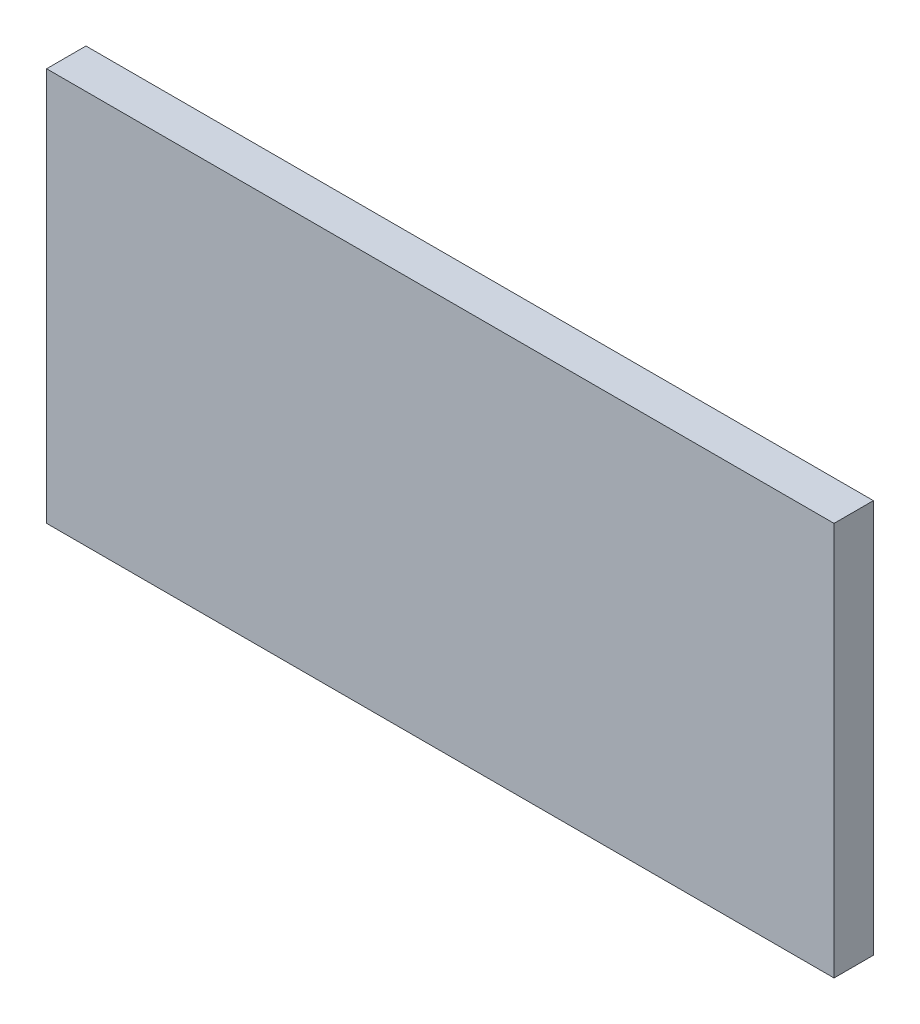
ISO-10303-21;
HEADER;
FILE_DESCRIPTION(('STEP AP214'),'2;1');
FILE_NAME('part.step','',(''),(''),'','','');
FILE_SCHEMA(('AUTOMOTIVE_DESIGN { 1 0 10303 214 1 1 1 1 }'));
ENDSEC;
DATA;
#1=APPLICATION_CONTEXT('core data for automotive mechanical design processes');
#2=APPLICATION_PROTOCOL_DEFINITION('international standard','automotive_design',2000,#1);
#3=PRODUCT_CONTEXT('',#1,'mechanical');
#4=PRODUCT('Part','Part','',(#3));
#5=PRODUCT_RELATED_PRODUCT_CATEGORY('part','',(#4));
#6=PRODUCT_DEFINITION_FORMATION('','',#4);
#7=PRODUCT_DEFINITION_CONTEXT('part definition',#1,'design');
#8=PRODUCT_DEFINITION('design','',#6,#7);
#9=PRODUCT_DEFINITION_SHAPE('','',#8);
#10=(LENGTH_UNIT() NAMED_UNIT(*) SI_UNIT(.MILLI.,.METRE.));
#11=(NAMED_UNIT(*) PLANE_ANGLE_UNIT() SI_UNIT($,.RADIAN.));
#12=(NAMED_UNIT(*) SI_UNIT($,.STERADIAN.) SOLID_ANGLE_UNIT());
#13=UNCERTAINTY_MEASURE_WITH_UNIT(LENGTH_MEASURE(1.E-05),#10,'distance_accuracy_value','');
#14=(GEOMETRIC_REPRESENTATION_CONTEXT(3) GLOBAL_UNCERTAINTY_ASSIGNED_CONTEXT((#13)) GLOBAL_UNIT_ASSIGNED_CONTEXT((#10,
#11,#12)) REPRESENTATION_CONTEXT('',''));
#15=CARTESIAN_POINT('',(0.,0.,0.));
#16=DIRECTION('',(0.,0.,1.));
#17=DIRECTION('',(1.,0.,0.));
#18=AXIS2_PLACEMENT_3D('',#15,#16,#17);
#19=CARTESIAN_POINT('',(-100.,-50.,10.));
#20=DIRECTION('',(1.,0.,0.));
#21=DIRECTION('',(0.,0.,-1.));
#22=AXIS2_PLACEMENT_3D('',#19,#20,#21);
#23=PLANE('',#22);
#24=DIRECTION('',(0.,-1.,0.));
#25=VECTOR('',#24,1.);
#26=CARTESIAN_POINT('',(-100.,-50.,0.));
#27=LINE('',#26,#25);
#28=CARTESIAN_POINT('',(-100.,50.,0.));
#29=VERTEX_POINT('',#28);
#30=CARTESIAN_POINT('',(-100.,-50.,0.));
#31=VERTEX_POINT('',#30);
#32=EDGE_CURVE('E113',#29,#31,#27,.T.);
#33=ORIENTED_EDGE('',*,*,#32,.T.);
#34=DIRECTION('',(0.,0.,-1.));
#35=VECTOR('',#34,1.);
#36=CARTESIAN_POINT('',(-100.,-50.,10.));
#37=LINE('',#36,#35);
#38=CARTESIAN_POINT('',(-100.,-50.,10.));
#39=VERTEX_POINT('',#38);
#40=EDGE_CURVE('E11',#39,#31,#37,.T.);
#41=ORIENTED_EDGE('',*,*,#40,.F.);
#42=DIRECTION('',(0.,-1.,0.));
#43=VECTOR('',#42,1.);
#44=CARTESIAN_POINT('',(-100.,-50.,10.));
#45=LINE('',#44,#43);
#46=CARTESIAN_POINT('',(-100.,50.,10.));
#47=VERTEX_POINT('',#46);
#48=EDGE_CURVE('E97',#47,#39,#45,.T.);
#49=ORIENTED_EDGE('',*,*,#48,.F.);
#50=DIRECTION('',(0.,0.,-1.));
#51=VECTOR('',#50,1.);
#52=CARTESIAN_POINT('',(-100.,50.,10.));
#53=LINE('',#52,#51);
#54=EDGE_CURVE('E109',#47,#29,#53,.T.);
#55=ORIENTED_EDGE('',*,*,#54,.T.);
#56=EDGE_LOOP('',(#33,#41,#49,#55));
#57=FACE_BOUND('',#56,.T.);
#58=ADVANCED_FACE('F45',(#57),#23,.F.);
#59=CARTESIAN_POINT('',(100.,-50.,10.));
#60=DIRECTION('',(0.,1.,0.));
#61=DIRECTION('',(-1.,0.,0.));
#62=AXIS2_PLACEMENT_3D('',#59,#60,#61);
#63=PLANE('',#62);
#64=DIRECTION('',(1.,0.,0.));
#65=VECTOR('',#64,1.);
#66=CARTESIAN_POINT('',(100.,-50.,0.));
#67=LINE('',#66,#65);
#68=CARTESIAN_POINT('',(100.,-50.,0.));
#69=VERTEX_POINT('',#68);
#70=EDGE_CURVE('E102',#31,#69,#67,.T.);
#71=ORIENTED_EDGE('',*,*,#70,.T.);
#72=DIRECTION('',(0.,0.,-1.));
#73=VECTOR('',#72,1.);
#74=CARTESIAN_POINT('',(100.,-50.,10.));
#75=LINE('',#74,#73);
#76=CARTESIAN_POINT('',(100.,-50.,10.));
#77=VERTEX_POINT('',#76);
#78=EDGE_CURVE('E54',#77,#69,#75,.T.);
#79=ORIENTED_EDGE('',*,*,#78,.F.);
#80=DIRECTION('',(1.,0.,0.));
#81=VECTOR('',#80,1.);
#82=CARTESIAN_POINT('',(100.,-50.,10.));
#83=LINE('',#82,#81);
#84=EDGE_CURVE('E92',#39,#77,#83,.T.);
#85=ORIENTED_EDGE('',*,*,#84,.F.);
#86=ORIENTED_EDGE('',*,*,#40,.T.);
#87=EDGE_LOOP('',(#71,#79,#85,#86));
#88=FACE_BOUND('',#87,.T.);
#89=ADVANCED_FACE('F101',(#88),#63,.F.);
#90=CARTESIAN_POINT('',(100.,-50.,10.));
#91=DIRECTION('',(-1.,0.,0.));
#92=DIRECTION('',(0.,0.,1.));
#93=AXIS2_PLACEMENT_3D('',#90,#91,#92);
#94=PLANE('',#93);
#95=DIRECTION('',(0.,1.,0.));
#96=VECTOR('',#95,1.);
#97=CARTESIAN_POINT('',(100.,-50.,0.));
#98=LINE('',#97,#96);
#99=CARTESIAN_POINT('',(100.,50.,0.));
#100=VERTEX_POINT('',#99);
#101=EDGE_CURVE('E79',#69,#100,#98,.T.);
#102=ORIENTED_EDGE('',*,*,#101,.T.);
#103=DIRECTION('',(0.,0.,-1.));
#104=VECTOR('',#103,1.);
#105=CARTESIAN_POINT('',(100.,50.,10.));
#106=LINE('',#105,#104);
#107=CARTESIAN_POINT('',(100.,50.,10.));
#108=VERTEX_POINT('',#107);
#109=EDGE_CURVE('E104',#108,#100,#106,.T.);
#110=ORIENTED_EDGE('',*,*,#109,.F.);
#111=DIRECTION('',(0.,1.,0.));
#112=VECTOR('',#111,1.);
#113=CARTESIAN_POINT('',(100.,-50.,10.));
#114=LINE('',#113,#112);
#115=EDGE_CURVE('E95',#77,#108,#114,.T.);
#116=ORIENTED_EDGE('',*,*,#115,.F.);
#117=ORIENTED_EDGE('',*,*,#78,.T.);
#118=EDGE_LOOP('',(#102,#110,#116,#117));
#119=FACE_BOUND('',#118,.T.);
#120=ADVANCED_FACE('F105',(#119),#94,.F.);
#121=CARTESIAN_POINT('',(100.,50.,10.));
#122=DIRECTION('',(0.,-1.,0.));
#123=DIRECTION('',(1.,0.,0.));
#124=AXIS2_PLACEMENT_3D('',#121,#122,#123);
#125=PLANE('',#124);
#126=DIRECTION('',(-1.,0.,0.));
#127=VECTOR('',#126,1.);
#128=CARTESIAN_POINT('',(100.,50.,0.));
#129=LINE('',#128,#127);
#130=EDGE_CURVE('E85',#100,#29,#129,.T.);
#131=ORIENTED_EDGE('',*,*,#130,.T.);
#132=ORIENTED_EDGE('',*,*,#54,.F.);
#133=DIRECTION('',(-1.,0.,0.));
#134=VECTOR('',#133,1.);
#135=CARTESIAN_POINT('',(100.,50.,10.));
#136=LINE('',#135,#134);
#137=EDGE_CURVE('E62',#108,#47,#136,.T.);
#138=ORIENTED_EDGE('',*,*,#137,.F.);
#139=ORIENTED_EDGE('',*,*,#109,.T.);
#140=EDGE_LOOP('',(#131,#132,#138,#139));
#141=FACE_BOUND('',#140,.T.);
#142=ADVANCED_FACE('F126',(#141),#125,.F.);
#143=CARTESIAN_POINT('',(0.,0.,10.));
#144=DIRECTION('',(0.,0.,1.));
#145=DIRECTION('',(1.,0.,0.));
#146=AXIS2_PLACEMENT_3D('',#143,#144,#145);
#147=PLANE('',#146);
#148=ORIENTED_EDGE('',*,*,#48,.T.);
#149=ORIENTED_EDGE('',*,*,#84,.T.);
#150=ORIENTED_EDGE('',*,*,#115,.T.);
#151=ORIENTED_EDGE('',*,*,#137,.T.);
#152=EDGE_LOOP('',(#148,#149,#150,#151));
#153=FACE_BOUND('',#152,.T.);
#154=ADVANCED_FACE('F93',(#153),#147,.T.);
#155=CARTESIAN_POINT('',(0.,0.,0.));
#156=DIRECTION('',(0.,0.,1.));
#157=DIRECTION('',(1.,0.,0.));
#158=AXIS2_PLACEMENT_3D('',#155,#156,#157);
#159=PLANE('',#158);
#160=ORIENTED_EDGE('',*,*,#32,.F.);
#161=ORIENTED_EDGE('',*,*,#130,.F.);
#162=ORIENTED_EDGE('',*,*,#101,.F.);
#163=ORIENTED_EDGE('',*,*,#70,.F.);
#164=EDGE_LOOP('',(#160,#161,#162,#163));
#165=FACE_BOUND('',#164,.T.);
#166=ADVANCED_FACE('F129',(#165),#159,.F.);
#167=CLOSED_SHELL('',(#58,#89,#120,#142,#154,#166));
#168=MANIFOLD_SOLID_BREP('B2',#167);
#169=ADVANCED_BREP_SHAPE_REPRESENTATION('',(#18,#168),#14);
#170=SHAPE_DEFINITION_REPRESENTATION(#9,#169);
ENDSEC;
END-ISO-10303-21;
